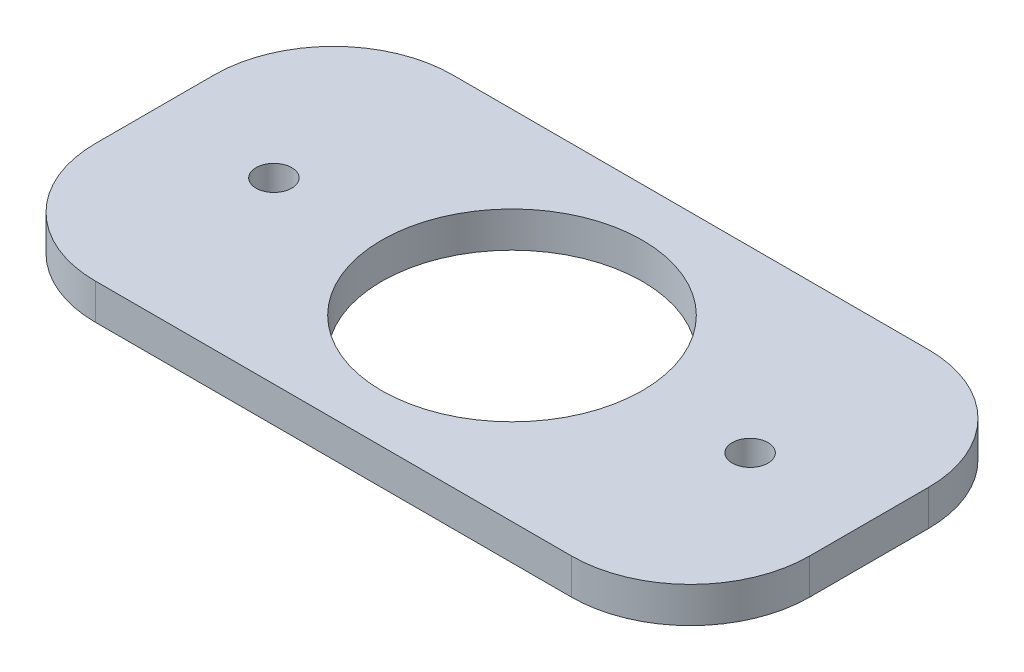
from build123d import *

# Parameters (mm, degrees)
CROQUIS1_W              = 60
CROQUIS1_H              = 30
SALIENTE_EXTRUIR2_DEPTH = 3
CROQUIS3_R              = 10.95
SALIENTE_EXTRUIR3_DEPTH = 1
CROQUIS6_R              = 1.5
CORTAR_EXTRUIR5_DEPTH   = 24
REDONDEO1_R             = 10
REDONDEO2_R             = 10
REDONDEO3_R             = 10
REDONDEO4_R             = 10
CORTAR_EXTRUIR6_START   = -24
CROQUIS7_R              = 10.95
CORTAR_EXTRUIR6_DEPTH   = 24


with BuildPart() as part:
    # Croquis1 → Saliente-Extruir2 (new body)
    with BuildSketch(Plane(origin=(0, 0, 0), x_dir=(1, 0, 0), z_dir=(0, 1, 0))):
        Rectangle(CROQUIS1_W, CROQUIS1_H)
    extrude(amount=SALIENTE_EXTRUIR2_DEPTH)

    # Croquis3 → Saliente-Extruir3 (add)
    with BuildSketch(Plane(origin=(0, 3, 0), x_dir=(1, 0, 0), z_dir=(0, 1, 0))):
        with Locations(Location((0, 0, 0), (0, 0, 270))):
            Circle(CROQUIS3_R)
    extrude(amount=SALIENTE_EXTRUIR3_DEPTH)

    # Croquis6 → Cortar-Extruir5 (cut)
    with BuildSketch(Plane(origin=(0, 4, 0), x_dir=(1, 0, 0), z_dir=(0, 1, 0))):
        with Locations(Location((-20, 0, 0), (0, 0, 90))):
            Circle(CROQUIS6_R)
        with Locations(Location((20, 0, 0), (0, 0, 90))):
            Circle(CROQUIS6_R)
    extrude(amount=-CORTAR_EXTRUIR5_DEPTH, mode=Mode.SUBTRACT)

    # Redondeo1
    redondeo1_edges = [part.edges().sort_by_distance(p)[0] for p in [
        (-30, 1.5, -15),
    ]]
    fillet(redondeo1_edges, radius=REDONDEO1_R)

    # Redondeo2
    redondeo2_edges = [part.edges().sort_by_distance(p)[0] for p in [
        (30, 1.5, -15),
    ]]
    fillet(redondeo2_edges, radius=REDONDEO2_R)

    # Redondeo3
    redondeo3_edges = [part.edges().sort_by_distance(p)[0] for p in [
        (-30, 1.5, 15),
    ]]
    fillet(redondeo3_edges, radius=REDONDEO3_R)

    # Redondeo4
    redondeo4_edges = [part.edges().sort_by_distance(p)[0] for p in [
        (30, 1.5, 15),
    ]]
    fillet(redondeo4_edges, radius=REDONDEO4_R)

    # Croquis7 → Cortar-Extruir6 (cut)
    with BuildSketch(Plane(origin=(0, 4, 0), x_dir=(1, 0, 0), z_dir=(0, 1, 0)).offset(CORTAR_EXTRUIR6_START)):
        with Locations(Location((0, 0, 0), (0, 0, 90))):
            Circle(CROQUIS7_R)
    extrude(amount=CORTAR_EXTRUIR6_DEPTH, mode=Mode.SUBTRACT)


solid = part.part
